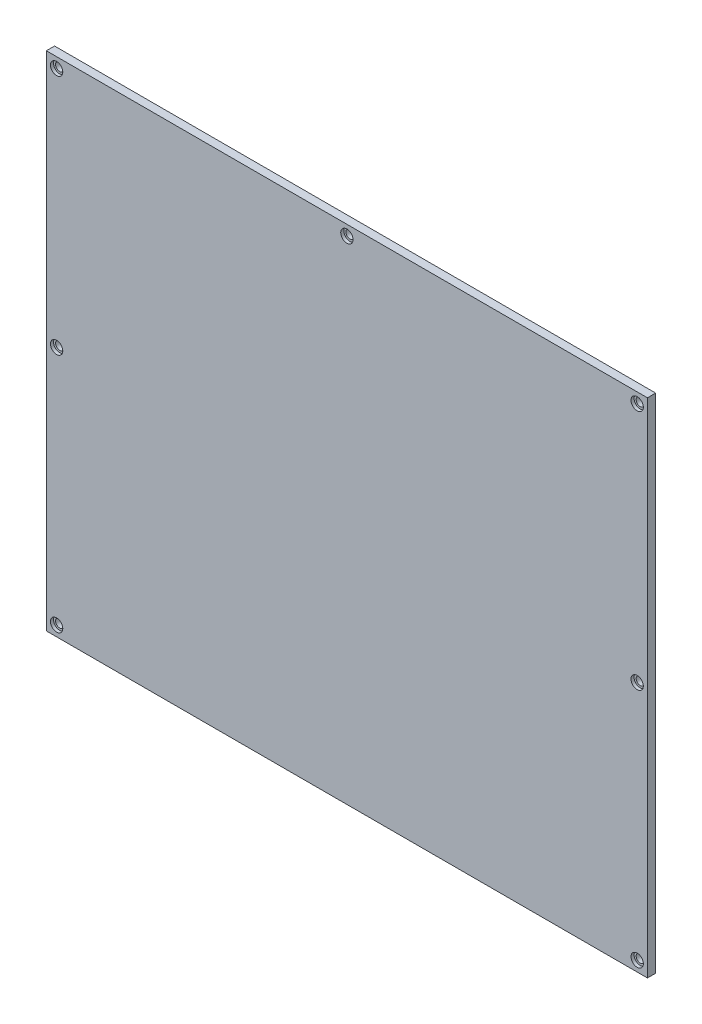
from build123d import *

# Parameters (mm, degrees)
SKETCH1_W           = 585
SKETCH1_H           = 489
BOSS_EXTRUDE1_DEPTH = 8
SKETCH2_R           = 4
CUT_EXTRUDE1_DEPTH  = 8
SKETCH3_R           = 6
CUT_EXTRUDE2_DEPTH  = 3


with BuildPart() as part:
    # Sketch1 → Boss-Extrude1 (new body)
    with BuildSketch(Plane.XY):
        with Locations((292.5, 244.5)):
            Rectangle(SKETCH1_W, SKETCH1_H)
    extrude(amount=BOSS_EXTRUDE1_DEPTH)

    # Sketch2 → Cut-Extrude1 (cut)
    with BuildSketch(Plane.XY.offset(8)):
        with Locations((10, 479)):
            Circle(SKETCH2_R)
        with Locations((10, 10)):
            Circle(SKETCH2_R)
        with Locations((10, 244)):
            Circle(SKETCH2_R)
        with Locations((292.5, 479)):
            Circle(SKETCH2_R)
        with Locations((575, 479)):
            Circle(SKETCH2_R)
        with Locations((575, 244)):
            Circle(SKETCH2_R)
        with Locations((575, 10)):
            Circle(SKETCH2_R)
    extrude(amount=-CUT_EXTRUDE1_DEPTH, mode=Mode.SUBTRACT)

    # Sketch3 → Cut-Extrude2 (cut)
    with BuildSketch(Plane.XY.offset(8)):
        with Locations((10, 479)):
            Circle(SKETCH3_R)
        with Locations((292.5, 479)):
            Circle(SKETCH3_R)
        with Locations((575, 244)):
            Circle(SKETCH3_R)
        with Locations((575, 479)):
            Circle(SKETCH3_R)
        with Locations((10, 244)):
            Circle(SKETCH3_R)
        with Locations((10, 10)):
            Circle(SKETCH3_R)
        with Locations((575, 10)):
            Circle(SKETCH3_R)
    extrude(amount=-CUT_EXTRUDE2_DEPTH, mode=Mode.SUBTRACT)


solid = part.part
